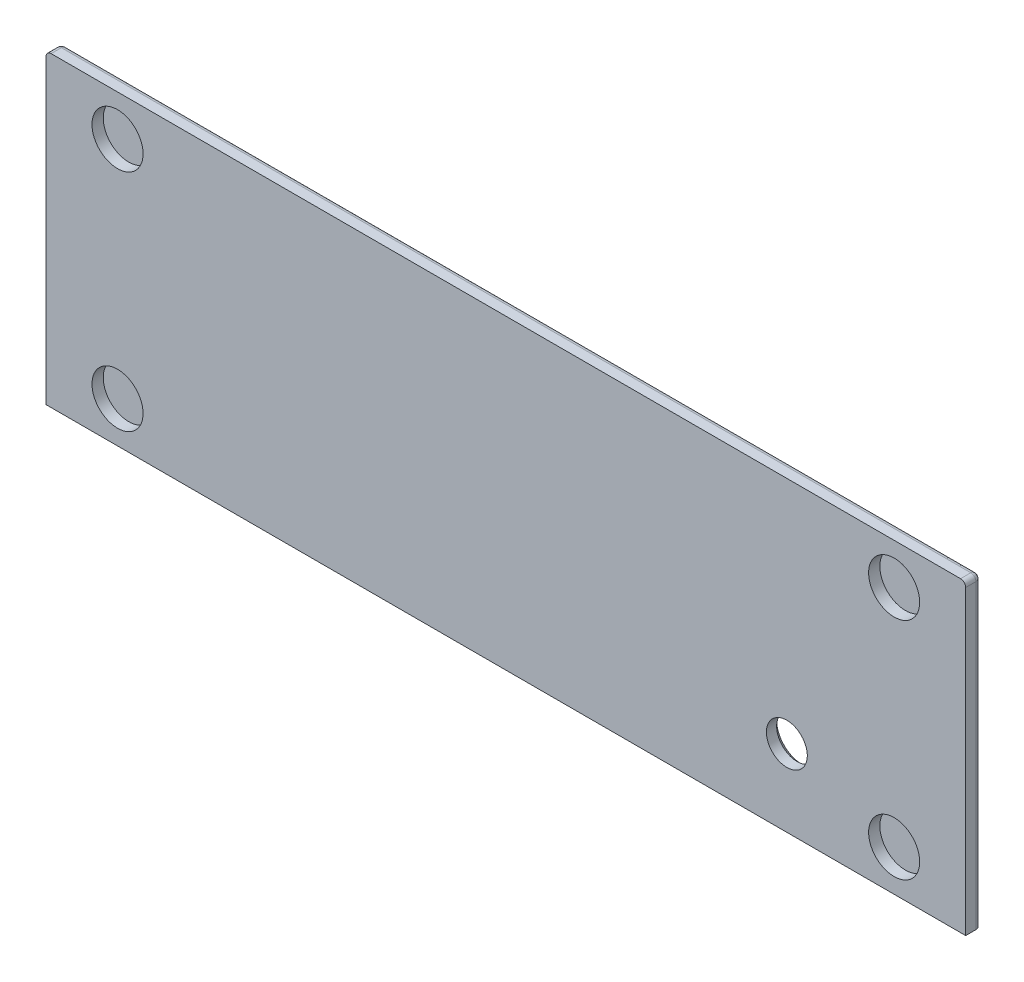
from build123d import *

# Parameters (mm, degrees)
SKIZZE1_W                       = 180
SKIZZE1_H                       = 60
AUFSATZ_LINEAR_AUSTRAGEN1_DEPTH = 3
SKIZZE2_R                       = 5
SCHNITT_LINEAR_AUSTRAGEN1_DEPTH = 2.2
VERRUNDUNG1_R                   = 1
SKIZZE3_R                       = 4
SCHNITT_LINEAR_AUSTRAGEN2_DEPTH = 10
FASE1_SIZE                      = 1


with BuildPart() as part:
    # Skizze1 → Aufsatz-Linear austragen1 (new body)
    with BuildSketch(Plane.XY):
        Rectangle(SKIZZE1_W, SKIZZE1_H)
    extrude(amount=AUFSATZ_LINEAR_AUSTRAGEN1_DEPTH)

    # Skizze2 → Schnitt-Linear austragen1 (cut)
    with BuildSketch(Plane.XY.offset(3)):
        with Locations((-76, 22)):
            Circle(SKIZZE2_R)
        with Locations((-76, -22)):
            Circle(SKIZZE2_R)
        with Locations((76, -22)):
            Circle(SKIZZE2_R)
        with Locations((76, 22)):
            Circle(SKIZZE2_R)
    extrude(amount=-SCHNITT_LINEAR_AUSTRAGEN1_DEPTH, mode=Mode.SUBTRACT)

    # Verrundung1
    verrundung1_edges = [part.edges().sort_by_distance(p)[0] for p in [
        (-90, 0, 0),
        (0, 30, 0),
        (90, 0, 0),
        (-90, 30, 1.5),
        (90, 30, 1.5),
    ]]
    fillet(verrundung1_edges, radius=VERRUNDUNG1_R)

    # Skizze3 → Schnitt-Linear austragen2 (cut)
    with BuildSketch(Plane(origin=(0, 0, 0), x_dir=(-1, 0, 0), z_dir=(0, 0, -1))):
        with Locations((-55, -15)):
            Circle(SKIZZE3_R)
    extrude(amount=-SCHNITT_LINEAR_AUSTRAGEN2_DEPTH, mode=Mode.SUBTRACT)

    # Fase1
    fase1_edges = [part.edges().sort_by_distance(p)[0] for p in [
        (59, -15, 0),
    ]]
    chamfer(fase1_edges, length=FASE1_SIZE)


solid = part.part
